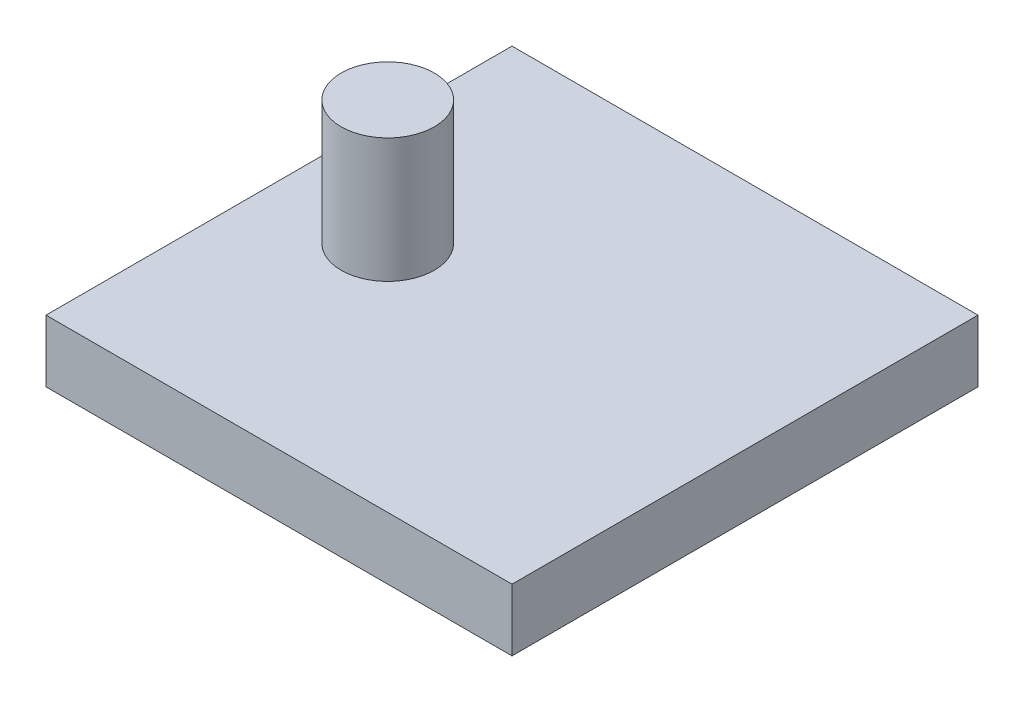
from build123d import *

# Parameters (mm, degrees)
SKETCH1_W      = 150
SKETCH1_H      = 150
EXTRUDE1_DEPTH = 20
SKETCH2_R      = 15
EXTRUDE2_DEPTH = 40


with BuildPart() as part:
    # Sketch1 → Extrude1 (new body)
    with BuildSketch(Plane(origin=(0, 0, 0), x_dir=(1, 0, 0), z_dir=(0, 1, 0))):
        Rectangle(SKETCH1_W, SKETCH1_H)
    extrude(amount=EXTRUDE1_DEPTH)

    # Sketch2 → Extrude2 (add)
    with BuildSketch(Plane(origin=(0, 20, 0), x_dir=(-1, 0, 0), z_dir=(0, 1, 0))):
        with Locations(Location((40, 0, 0), (0, 0, 90))):
            Circle(SKETCH2_R)
    extrude(amount=EXTRUDE2_DEPTH)


solid = part.part
